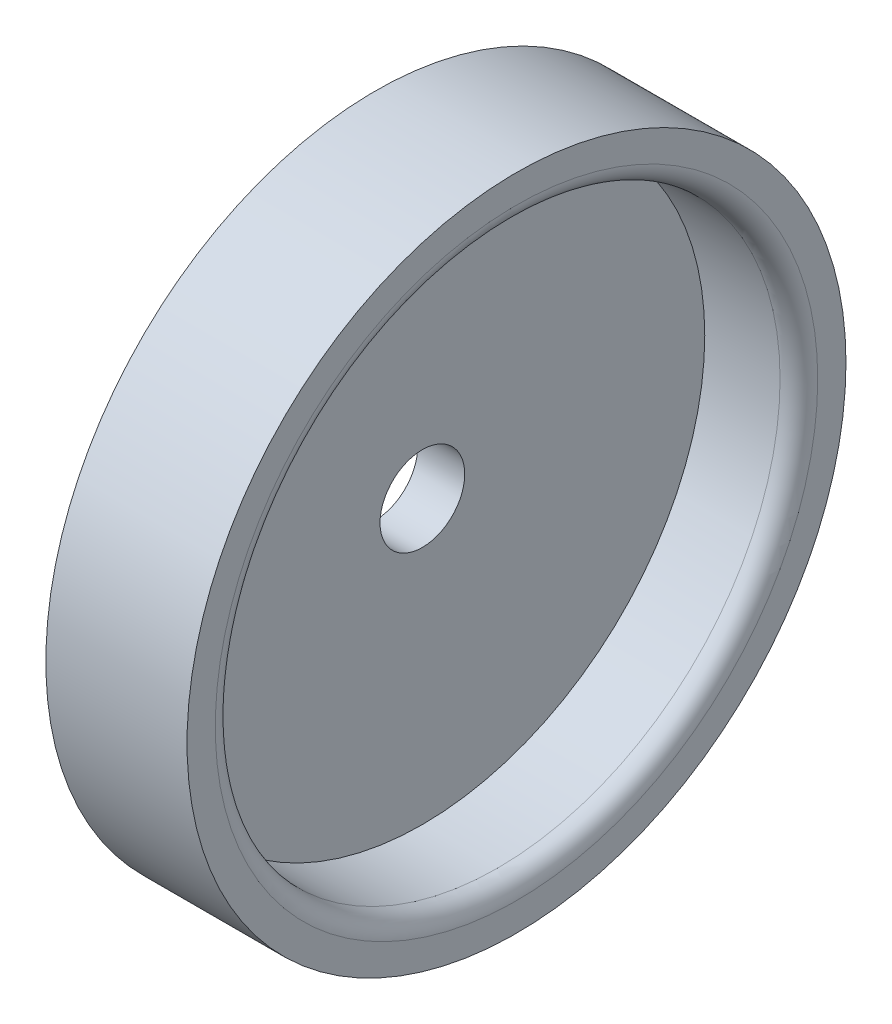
ISO-10303-21;
HEADER;
FILE_DESCRIPTION(('STEP AP214'),'2;1');
FILE_NAME('part.step','',(''),(''),'','','');
FILE_SCHEMA(('AUTOMOTIVE_DESIGN { 1 0 10303 214 1 1 1 1 }'));
ENDSEC;
DATA;
#1=APPLICATION_CONTEXT('core data for automotive mechanical design processes');
#2=APPLICATION_PROTOCOL_DEFINITION('international standard','automotive_design',2000,#1);
#3=PRODUCT_CONTEXT('',#1,'mechanical');
#4=PRODUCT('Part','Part','',(#3));
#5=PRODUCT_RELATED_PRODUCT_CATEGORY('part','',(#4));
#6=PRODUCT_DEFINITION_FORMATION('','',#4);
#7=PRODUCT_DEFINITION_CONTEXT('part definition',#1,'design');
#8=PRODUCT_DEFINITION('design','',#6,#7);
#9=PRODUCT_DEFINITION_SHAPE('','',#8);
#10=(LENGTH_UNIT() NAMED_UNIT(*) SI_UNIT(.MILLI.,.METRE.));
#11=(NAMED_UNIT(*) PLANE_ANGLE_UNIT() SI_UNIT($,.RADIAN.));
#12=(NAMED_UNIT(*) SI_UNIT($,.STERADIAN.) SOLID_ANGLE_UNIT());
#13=UNCERTAINTY_MEASURE_WITH_UNIT(LENGTH_MEASURE(1.E-05),#10,'distance_accuracy_value','');
#14=(GEOMETRIC_REPRESENTATION_CONTEXT(3) GLOBAL_UNCERTAINTY_ASSIGNED_CONTEXT((#13)) GLOBAL_UNIT_ASSIGNED_CONTEXT((#10,
#11,#12)) REPRESENTATION_CONTEXT('',''));
#15=CARTESIAN_POINT('',(0.,0.,0.));
#16=DIRECTION('',(0.,0.,1.));
#17=DIRECTION('',(1.,0.,0.));
#18=AXIS2_PLACEMENT_3D('',#15,#16,#17);
#19=CARTESIAN_POINT('',(0.,0.,0.));
#20=DIRECTION('',(1.,0.,0.));
#21=DIRECTION('',(0.,0.,-1.));
#22=AXIS2_PLACEMENT_3D('',#19,#20,#21);
#23=PLANE('',#22);
#24=CARTESIAN_POINT('',(0.,0.,0.));
#25=DIRECTION('',(1.,0.,0.));
#26=DIRECTION('',(0.,0.,-1.));
#27=AXIS2_PLACEMENT_3D('',#24,#25,#26);
#28=CIRCLE('',#27,4.5);
#29=CARTESIAN_POINT('',(0.,0.,-4.5));
#30=VERTEX_POINT('',#29);
#31=EDGE_CURVE('E56',#30,#30,#28,.T.);
#32=ORIENTED_EDGE('',*,*,#31,.F.);
#33=EDGE_LOOP('',(#32));
#34=FACE_BOUND('',#33,.T.);
#35=CARTESIAN_POINT('',(0.,0.,0.));
#36=DIRECTION('',(1.,0.,0.));
#37=DIRECTION('',(0.,0.,-1.));
#38=AXIS2_PLACEMENT_3D('',#35,#36,#37);
#39=CIRCLE('',#38,30.);
#40=CARTESIAN_POINT('',(0.,0.,-30.));
#41=VERTEX_POINT('',#40);
#42=EDGE_CURVE('E44',#41,#41,#39,.T.);
#43=ORIENTED_EDGE('',*,*,#42,.T.);
#44=EDGE_LOOP('',(#43));
#45=FACE_BOUND('',#44,.T.);
#46=ADVANCED_FACE('F33',(#34,#45),#23,.T.);
#47=CARTESIAN_POINT('',(0.,0.,0.));
#48=DIRECTION('',(1.,0.,0.));
#49=DIRECTION('',(0.,0.,-1.));
#50=AXIS2_PLACEMENT_3D('',#47,#48,#49);
#51=CYLINDRICAL_SURFACE('',#50,30.);
#52=CARTESIAN_POINT('',(8.,0.,0.));
#53=DIRECTION('',(1.,0.,0.));
#54=DIRECTION('',(0.,0.,-1.));
#55=AXIS2_PLACEMENT_3D('',#52,#53,#54);
#56=CIRCLE('',#55,30.);
#57=CARTESIAN_POINT('',(8.,0.,-30.));
#58=VERTEX_POINT('',#57);
#59=EDGE_CURVE('E40',#58,#58,#56,.T.);
#60=ORIENTED_EDGE('',*,*,#59,.T.);
#61=EDGE_LOOP('',(#60));
#62=FACE_BOUND('',#61,.T.);
#63=ORIENTED_EDGE('',*,*,#42,.F.);
#64=EDGE_LOOP('',(#63));
#65=FACE_BOUND('',#64,.T.);
#66=ADVANCED_FACE('F79',(#62,#65),#51,.F.);
#67=CARTESIAN_POINT('',(10.,30.,0.));
#68=DIRECTION('',(1.,0.,0.));
#69=DIRECTION('',(0.,0.,-1.));
#70=AXIS2_PLACEMENT_3D('',#67,#68,#69);
#71=PLANE('',#70);
#72=CARTESIAN_POINT('',(10.,0.,0.));
#73=DIRECTION('',(1.,0.,0.));
#74=DIRECTION('',(0.,0.,-1.));
#75=AXIS2_PLACEMENT_3D('',#72,#73,#74);
#76=CIRCLE('',#75,32.);
#77=CARTESIAN_POINT('',(10.,0.,-32.));
#78=VERTEX_POINT('',#77);
#79=EDGE_CURVE('E10',#78,#78,#76,.F.);
#80=ORIENTED_EDGE('',*,*,#79,.T.);
#81=EDGE_LOOP('',(#80));
#82=FACE_BOUND('',#81,.T.);
#83=CARTESIAN_POINT('',(10.,0.,0.));
#84=DIRECTION('',(1.,0.,0.));
#85=DIRECTION('',(0.,0.,-1.));
#86=AXIS2_PLACEMENT_3D('',#83,#84,#85);
#87=CIRCLE('',#86,35.);
#88=CARTESIAN_POINT('',(10.,0.,-35.));
#89=VERTEX_POINT('',#88);
#90=EDGE_CURVE('E48',#89,#89,#87,.T.);
#91=ORIENTED_EDGE('',*,*,#90,.T.);
#92=EDGE_LOOP('',(#91));
#93=FACE_BOUND('',#92,.T.);
#94=ADVANCED_FACE('F74',(#82,#93),#71,.T.);
#95=CARTESIAN_POINT('',(0.,0.,0.));
#96=DIRECTION('',(1.,0.,0.));
#97=DIRECTION('',(0.,0.,-1.));
#98=AXIS2_PLACEMENT_3D('',#95,#96,#97);
#99=CYLINDRICAL_SURFACE('',#98,35.);
#100=CARTESIAN_POINT('',(-5.,0.,0.));
#101=DIRECTION('',(1.,0.,0.));
#102=DIRECTION('',(0.,0.,-1.));
#103=AXIS2_PLACEMENT_3D('',#100,#101,#102);
#104=CIRCLE('',#103,35.);
#105=CARTESIAN_POINT('',(-5.,0.,-35.));
#106=VERTEX_POINT('',#105);
#107=EDGE_CURVE('E53',#106,#106,#104,.T.);
#108=ORIENTED_EDGE('',*,*,#107,.T.);
#109=EDGE_LOOP('',(#108));
#110=FACE_BOUND('',#109,.T.);
#111=ORIENTED_EDGE('',*,*,#90,.F.);
#112=EDGE_LOOP('',(#111));
#113=FACE_BOUND('',#112,.T.);
#114=ADVANCED_FACE('F68',(#110,#113),#99,.T.);
#115=CARTESIAN_POINT('',(-5.,35.,0.));
#116=DIRECTION('',(-1.,0.,0.));
#117=DIRECTION('',(0.,0.,1.));
#118=AXIS2_PLACEMENT_3D('',#115,#116,#117);
#119=PLANE('',#118);
#120=CARTESIAN_POINT('',(-5.,0.,0.));
#121=DIRECTION('',(-1.,0.,0.));
#122=DIRECTION('',(0.,0.,1.));
#123=AXIS2_PLACEMENT_3D('',#120,#121,#122);
#124=CIRCLE('',#123,4.5);
#125=CARTESIAN_POINT('',(-5.,0.,4.5));
#126=VERTEX_POINT('',#125);
#127=EDGE_CURVE('E59',#126,#126,#124,.T.);
#128=ORIENTED_EDGE('',*,*,#127,.F.);
#129=EDGE_LOOP('',(#128));
#130=FACE_BOUND('',#129,.T.);
#131=ORIENTED_EDGE('',*,*,#107,.F.);
#132=EDGE_LOOP('',(#131));
#133=FACE_BOUND('',#132,.T.);
#134=ADVANCED_FACE('F65',(#130,#133),#119,.T.);
#135=CARTESIAN_POINT('',(8.,0.,0.));
#136=DIRECTION('',(1.,0.,0.));
#137=DIRECTION('',(0.,0.,-1.));
#138=AXIS2_PLACEMENT_3D('',#135,#136,#137);
#139=TOROIDAL_SURFACE('',#138,32.,2.);
#140=ORIENTED_EDGE('',*,*,#79,.F.);
#141=EDGE_LOOP('',(#140));
#142=FACE_BOUND('',#141,.T.);
#143=ORIENTED_EDGE('',*,*,#59,.F.);
#144=EDGE_LOOP('',(#143));
#145=FACE_BOUND('',#144,.T.);
#146=ADVANCED_FACE('F35',(#142,#145),#139,.T.);
#147=CARTESIAN_POINT('',(-5.,0.,0.));
#148=DIRECTION('',(-1.,0.,0.));
#149=DIRECTION('',(0.,0.,1.));
#150=AXIS2_PLACEMENT_3D('',#147,#148,#149);
#151=CYLINDRICAL_SURFACE('',#150,4.5);
#152=ORIENTED_EDGE('',*,*,#31,.T.);
#153=EDGE_LOOP('',(#152));
#154=FACE_BOUND('',#153,.T.);
#155=ORIENTED_EDGE('',*,*,#127,.T.);
#156=EDGE_LOOP('',(#155));
#157=FACE_BOUND('',#156,.T.);
#158=ADVANCED_FACE('F63',(#154,#157),#151,.F.);
#159=CLOSED_SHELL('',(#46,#66,#94,#114,#134,#146,#158));
#160=MANIFOLD_SOLID_BREP('B2',#159);
#161=ADVANCED_BREP_SHAPE_REPRESENTATION('',(#18,#160),#14);
#162=SHAPE_DEFINITION_REPRESENTATION(#9,#161);
ENDSEC;
END-ISO-10303-21;
